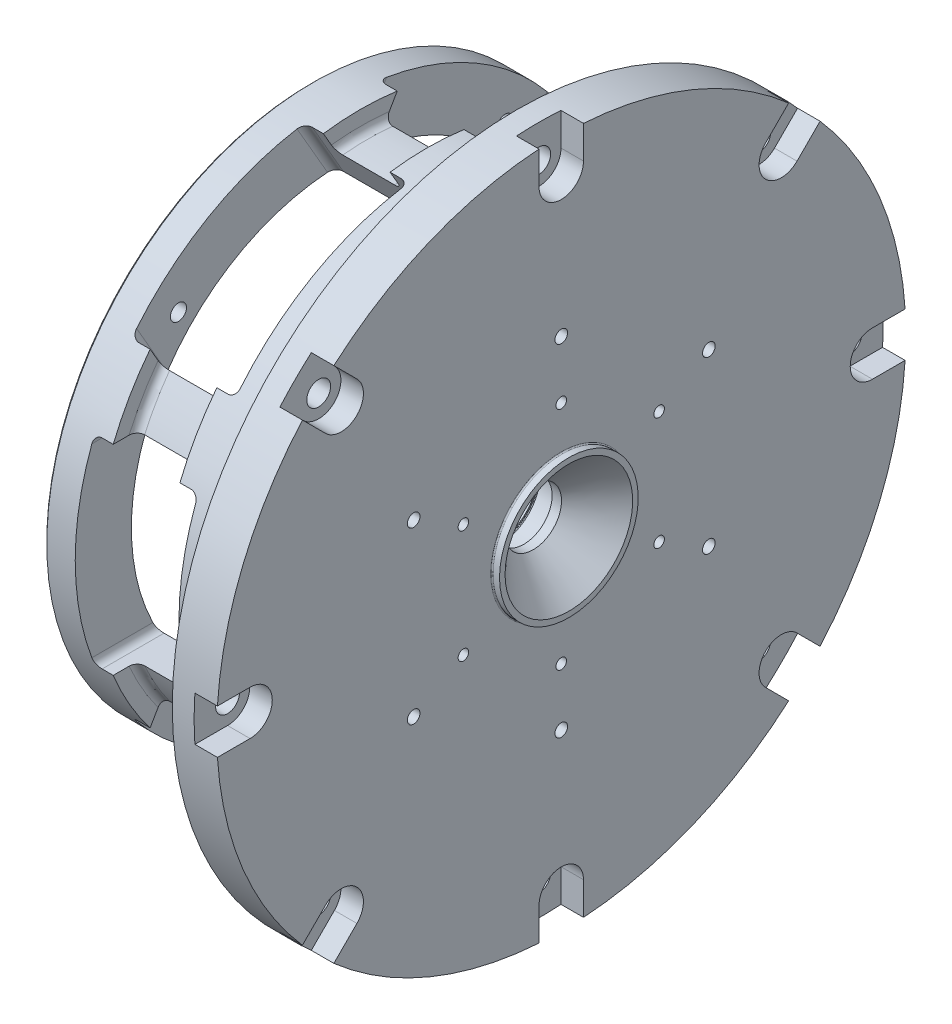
from build123d import *

# Parameters (mm, degrees)
WINDOWS_DEPTH                                   = 109.023865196
CIRPATTERN6_COUNT                               = 3
FILLET1_R                                       = 0.254
FILLET2_R                                       = 0.79375
CIRPATTERN1_COUNT                               = 4
CHAMFER1_SIZE                                   = 7.62
CIRPATTERN3_COUNT                               = 6
CIRPATTERN4_COUNT                               = 6
CHAMFER2_SIZE                                   = 0.508
SKETCH23_W                                      = 1.8796
SKETCH23_H                                      = 3.4544
CBORE_FOR_10_SOCKET_HEAD_CAP_SCREW1_D           = 5.1054
CBORE_FOR_10_SOCKET_HEAD_CAP_SCREW1_CBORE_D     = 9.525
CBORE_FOR_10_SOCKET_HEAD_CAP_SCREW1_CBORE_DEPTH = 4.826
CUT_EXTRUDE1_DEPTH                              = 4.826
CIRPATTERN5_COUNT                               = 8
CHAMFER3_SIZE                                   = 0.79375


with BuildPart() as part:
    # Sketch1 → Revolve1 (revolve)
    with BuildSketch(Plane.XY, mode=Mode.PRIVATE) as revolve1_sk:
        Polygon((-27.49375, 45.085), (-27.49375, 57.1119), (16.607, 57.1119), (16.607, 73.81875), (26.132, 73.81875), (26.132, 14.859), (27.7622, 14.859), (27.7622, 6.05), (18.131, 6.05), (18.131, 8.50011), (11.4, 8.50011), (11.4, 45.085), align=None)
    revolve(revolve1_sk.sketch.rotate(Axis((0, 0, 0), (1, 0, 0)), 90), axis=Axis((0, 0, 0), (1, 0, 0)))

    # Sketch7 → Groove for AS 568-244_ O-Ring1 (revolve, cut)
    with BuildSketch(Plane(origin=(0, 0, 0), x_dir=(0, 1, 0), z_dir=(0, 0, 1))):
        with BuildLine():
            Line((54.562462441, -7.080764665), (57.1119, -6.85771778))
            Line((57.1119, -6.85771778), (57.1119, -12.08783222))
            Line((57.1119, -12.08783222), (54.562462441, -11.864785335))
            ThreePointArc((54.562462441, -11.864785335), (54.397331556, -11.783351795), (54.3306, -11.611751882))
            Line((54.3306, -11.611751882), (54.3306, -7.333798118))
            ThreePointArc((54.3306, -7.333798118), (54.397331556, -7.162198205), (54.562462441, -7.080764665))
        make_face()
    revolve(axis=Axis((-50, 0, 0), (1, 0, 0)), mode=Mode.SUBTRACT)

    # Sketch27 → Windows (cut, symmetric)
    with BuildSketch(Plane.XY):
        with BuildLine():
            Line((-19.30225, 21.43125), (-0.25225, 21.43125))
            ThreePointArc((-0.25225, 21.43125), (0.870282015, 20.966282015), (1.33525, 19.84375))
            Line((1.33525, 19.84375), (1.33525, -19.84375))
            ThreePointArc((1.33525, -19.84375), (0.870282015, -20.966282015), (-0.25225, -21.43125))
            Line((-0.25225, -21.43125), (-19.30225, -21.43125))
            ThreePointArc((-19.30225, -21.43125), (-20.424782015, -20.966282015), (-20.88975, -19.84375))
            Line((-20.88975, -19.84375), (-20.88975, 19.84375))
            ThreePointArc((-20.88975, 19.84375), (-20.424782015, 20.966282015), (-19.30225, 21.43125))
        make_face()
    windows = extrude(amount=WINDOWS_DEPTH, both=True, mode=Mode.SUBTRACT)

    # CirPattern6: Windows ×3 about axis
    cirpattern6_axis = Axis((0, 0, 0), (1, 0, 0))
    for i in range(1, CIRPATTERN6_COUNT):
        add(windows.rotate(cirpattern6_axis, i * 360 / CIRPATTERN6_COUNT), mode=Mode.SUBTRACT)

    # Sketch11 → Groove for Smalley VHM-17 (revolve, cut)
    with BuildSketch(Plane(origin=(0, 0, 0), x_dir=(0, 1, 0), z_dir=(0, 0, 1)), mode=Mode.PRIVATE) as groove_for_smalley_vhm_17_sk:
        with BuildLine():
            Line((8.76, -13.1056), (7.2, -13.1056))
            Line((7.2, -13.1056), (7.2, -12.5456))
            Line((7.2, -12.5456), (8.76, -12.5456))
            ThreePointArc((8.76, -12.5456), (8.830710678, -12.574889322), (8.86, -12.6456))
            Line((8.86, -12.6456), (8.86, -13.0056))
            ThreePointArc((8.86, -13.0056), (8.830710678, -13.076310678), (8.76, -13.1056))
        make_face()
    revolve(groove_for_smalley_vhm_17_sk.sketch.rotate(Axis((50, 0, 0), (-1, 0, 0)), 270), axis=Axis((50, 0, 0), (-1, 0, 0)), mode=Mode.SUBTRACT)

    # Fillet1
    fillet1_edges = [part.edges().sort_by_distance(p)[0] for p in [
        (18.131, 0, -8.50011),
        (26.132, 0, -14.859),
    ]]
    fillet(fillet1_edges, radius=FILLET1_R)

    # Fillet2
    fillet2_edges = [part.edges().sort_by_distance(p)[0] for p in [
        (11.4, 0, -45.085),
    ]]
    fillet(fillet2_edges, radius=FILLET2_R)

    # Sketch12 → 8-32 Tapped Hole1 (revolve, cut)
    with BuildSketch(Plane(origin=(-27.49375, 35.001805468, 35.001805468), x_dir=(0, 0, 1), z_dir=(0, 1, 0))):
        Polygon((0, 0), (0, 11.746446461), (1.7272, 10.70864), (1.7272, 0), align=None)
    f_8_32_tapped_hole1 = revolve(axis=Axis((-33.84375, 35.001805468, 35.001805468), (1, 0, 0)), mode=Mode.SUBTRACT)

    # CirPattern1: 8-32 Tapped Hole1 ×4 about axis
    cirpattern1_axis = Axis((0, 0, 0), (1, 0, 0))
    for i in range(1, CIRPATTERN1_COUNT):
        add(f_8_32_tapped_hole1.rotate(cirpattern1_axis, i * 360 / CIRPATTERN1_COUNT), mode=Mode.SUBTRACT)

    # Chamfer1
    chamfer1_edges = [part.edges().sort_by_distance(p)[0] for p in [
        (27.7622, 0, -6.05),
    ]]
    chamfer(chamfer1_edges, length=CHAMFER1_SIZE)

    # Sketch15 → 4-40 Tapped Hole2 (revolve, cut)
    with BuildSketch(Plane(origin=(26.132, 24.209375, 0), x_dir=(0, 0, -1), z_dir=(0, 1, 0))):
        Polygon((0, 0), (0, 8.273752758), (1.1303, 7.5946), (1.1303, 0), align=None)
    f_4_40_tapped_hole2 = revolve(axis=Axis((32.482, 24.209375, 0), (-1, 0, 0)), mode=Mode.SUBTRACT)

    # CirPattern3: 4-40 Tapped Hole2 ×6 about axis
    cirpattern3_axis = Axis((0, 0, 0), (1, 0, 0))
    for i in range(1, CIRPATTERN3_COUNT):
        add(f_4_40_tapped_hole2.rotate(cirpattern3_axis, i * 360 / CIRPATTERN3_COUNT), mode=Mode.SUBTRACT)

    # Sketch17 → 6-32 Tapped Hole1 (revolve, cut)
    with BuildSketch(Plane(origin=(26.132, 36.5125, 0), x_dir=(0, 0, -1), z_dir=(0, 1, 0))):
        Polygon((0, 0), (0, 8.43269403), (1.35255, 7.62), (1.35255, 0), align=None)
    f_6_32_tapped_hole1 = revolve(axis=Axis((32.482, 36.5125, 0), (-1, 0, 0)), mode=Mode.SUBTRACT)

    # CirPattern4: 6-32 Tapped Hole1 ×6 about axis
    cirpattern4_axis = Axis((0, 0, 0), (1, 0, 0))
    for i in range(1, CIRPATTERN4_COUNT):
        add(f_6_32_tapped_hole1.rotate(cirpattern4_axis, i * 360 / CIRPATTERN4_COUNT), mode=Mode.SUBTRACT)

    # Chamfer2
    chamfer2_edges = [part.edges().sort_by_distance(p)[0] for p in [
        (-27.49375, 0, -57.1119),
    ]]
    chamfer(chamfer2_edges, length=CHAMFER2_SIZE)

    # Sketch23 → Cut-Revolve 2-157 (revolve, cut)
    with BuildSketch(Plane.XY):
        with Locations((17.5468, 60.9092)):
            Rectangle(SKETCH23_W, SKETCH23_H)
    revolve(axis=Axis((0, 0, 0), (-1, 0, 0)), mode=Mode.SUBTRACT)

    # CBORE for _10 Socket Head Cap Screw1 (through all)
    with Locations(Plane(origin=(26.132, 0, 0), x_dir=(0, 0, -1), z_dir=(1, 0, 0))):
        with Locations((0, 66.675)):
            cbore_for_10_socket_head_cap_screw1 = CounterBoreHole(CBORE_FOR_10_SOCKET_HEAD_CAP_SCREW1_D / 2, CBORE_FOR_10_SOCKET_HEAD_CAP_SCREW1_CBORE_D / 2, CBORE_FOR_10_SOCKET_HEAD_CAP_SCREW1_CBORE_DEPTH)

    # Sketch26 → Cut-Extrude1 (cut)
    with BuildSketch(Plane(origin=(26.132, 0, 0), x_dir=(0, 0, -1), z_dir=(1, 0, 0))):
        with BuildLine():
            Line((-4.7625, 66.675), (-4.7625, 87.321870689))
            Line((-4.7625, 87.321870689), (4.7625, 87.321870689))
            Line((4.7625, 87.321870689), (4.7625, 66.675))
            ThreePointArc((4.7625, 66.675), (0, 61.9125), (-4.7625, 66.675))
        make_face()
    cut_extrude1 = extrude(amount=-CUT_EXTRUDE1_DEPTH, mode=Mode.SUBTRACT)

    # CirPattern5: CBORE for _10 Socket Head Cap Screw1, Cut-Extrude1 ×8 about axis
    cirpattern5_axis = Axis((0, 0, 0), (1, 0, 0))
    add([cbore_for_10_socket_head_cap_screw1.rotate(cirpattern5_axis, i * 360 / CIRPATTERN5_COUNT) for i in range(1, CIRPATTERN5_COUNT)], mode=Mode.SUBTRACT)
    add([cut_extrude1.rotate(cirpattern5_axis, i * 360 / CIRPATTERN5_COUNT) for i in range(1, CIRPATTERN5_COUNT)], mode=Mode.SUBTRACT)

    # Chamfer3
    chamfer3_edges = [part.edges().sort_by_distance(p)[0] for p in [
        (-27.49375, 0, -45.085),
    ]]
    chamfer(chamfer3_edges, length=CHAMFER3_SIZE)

    # Sketch28 → Relief Cut-Revolve1 (revolve, cut)
    with BuildSketch(Plane.XY, mode=Mode.PRIVATE) as relief_cut_revolve1_sk:
        with BuildLine():
            Line((-16.921, 57.1119), (-2.6335, 57.1119))
            Line((-2.6335, 57.1119), (-2.6335, 53.975))
            ThreePointArc((-2.6335, 53.975), (-3.098467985, 52.852467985), (-4.221, 52.3875))
            Line((-4.221, 52.3875), (-15.3335, 52.3875))
            ThreePointArc((-15.3335, 52.3875), (-16.456032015, 52.852467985), (-16.921, 53.975))
            Line((-16.921, 53.975), (-16.921, 57.1119))
        make_face()
    revolve(relief_cut_revolve1_sk.sketch.rotate(Axis((0, 0, 0), (-1, 0, 0)), 90), axis=Axis((0, 0, 0), (-1, 0, 0)), mode=Mode.SUBTRACT)


solid = part.part
